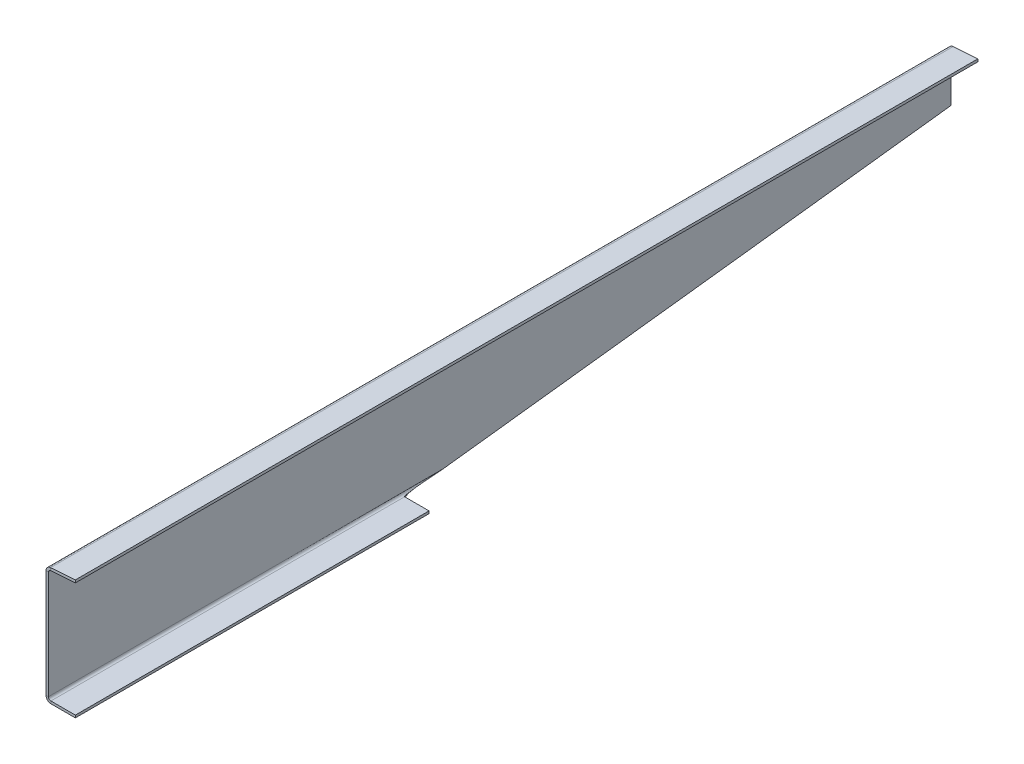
ISO-10303-21;
HEADER;
FILE_DESCRIPTION(('STEP AP214'),'2;1');
FILE_NAME('part.step','',(''),(''),'','','');
FILE_SCHEMA(('AUTOMOTIVE_DESIGN { 1 0 10303 214 1 1 1 1 }'));
ENDSEC;
DATA;
#1=APPLICATION_CONTEXT('core data for automotive mechanical design processes');
#2=APPLICATION_PROTOCOL_DEFINITION('international standard','automotive_design',2000,#1);
#3=PRODUCT_CONTEXT('',#1,'mechanical');
#4=PRODUCT('Part','Part','',(#3));
#5=PRODUCT_RELATED_PRODUCT_CATEGORY('part','',(#4));
#6=PRODUCT_DEFINITION_FORMATION('','',#4);
#7=PRODUCT_DEFINITION_CONTEXT('part definition',#1,'design');
#8=PRODUCT_DEFINITION('design','',#6,#7);
#9=PRODUCT_DEFINITION_SHAPE('','',#8);
#10=(LENGTH_UNIT() NAMED_UNIT(*) SI_UNIT(.MILLI.,.METRE.));
#11=(NAMED_UNIT(*) PLANE_ANGLE_UNIT() SI_UNIT($,.RADIAN.));
#12=(NAMED_UNIT(*) SI_UNIT($,.STERADIAN.) SOLID_ANGLE_UNIT());
#13=UNCERTAINTY_MEASURE_WITH_UNIT(LENGTH_MEASURE(1.E-05),#10,'distance_accuracy_value','');
#14=(GEOMETRIC_REPRESENTATION_CONTEXT(3) GLOBAL_UNCERTAINTY_ASSIGNED_CONTEXT((#13)) GLOBAL_UNIT_ASSIGNED_CONTEXT((#10,
#11,#12)) REPRESENTATION_CONTEXT('',''));
#15=CARTESIAN_POINT('',(0.,0.,0.));
#16=DIRECTION('',(0.,0.,1.));
#17=DIRECTION('',(1.,0.,0.));
#18=AXIS2_PLACEMENT_3D('',#15,#16,#17);
#19=CARTESIAN_POINT('',(12.2570463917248,299.291590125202,0.));
#20=DIRECTION('',(0.,0.,-1.));
#21=DIRECTION('',(-1.,0.,0.));
#22=AXIS2_PLACEMENT_3D('',#19,#20,#21);
#23=PLANE('',#22);
#24=DIRECTION('',(0.,1.,0.));
#25=VECTOR('',#24,1.);
#26=CARTESIAN_POINT('',(6.35,0.,0.));
#27=LINE('',#26,#25);
#28=CARTESIAN_POINT('',(6.35,170.415443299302,-2.22044604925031E-13));
#29=VERTEX_POINT('',#28);
#30=CARTESIAN_POINT('',(6.35,292.957058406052,0.));
#31=VERTEX_POINT('',#30);
#32=EDGE_CURVE('E186',#29,#31,#27,.T.);
#33=ORIENTED_EDGE('',*,*,#32,.F.);
#34=DIRECTION('',(1.,0.,0.));
#35=VECTOR('',#34,1.);
#36=CARTESIAN_POINT('',(6.35,170.415443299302,-2.22044604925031E-13));
#37=LINE('',#36,#35);
#38=CARTESIAN_POINT('',(0.,170.415443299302,-4.44089209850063E-13));
#39=VERTEX_POINT('',#38);
#40=EDGE_CURVE('E57',#29,#39,#37,.F.);
#41=ORIENTED_EDGE('',*,*,#40,.T.);
#42=DIRECTION('',(0.,1.,0.));
#43=VECTOR('',#42,1.);
#44=CARTESIAN_POINT('',(0.,0.,0.));
#45=LINE('',#44,#43);
#46=CARTESIAN_POINT('',(0.,292.957058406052,0.));
#47=VERTEX_POINT('',#46);
#48=EDGE_CURVE('E184',#39,#47,#45,.T.);
#49=ORIENTED_EDGE('',*,*,#48,.T.);
#50=DIRECTION('',(1.,0.,0.));
#51=VECTOR('',#50,1.);
#52=CARTESIAN_POINT('',(0.,292.957058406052,0.));
#53=LINE('',#52,#51);
#54=EDGE_CURVE('E218',#47,#31,#53,.T.);
#55=ORIENTED_EDGE('',*,*,#54,.T.);
#56=EDGE_LOOP('',(#33,#41,#49,#55));
#57=FACE_BOUND('',#56,.T.);
#58=ADVANCED_FACE('F42',(#57),#23,.T.);
#59=CARTESIAN_POINT('',(0.,0.,2343.15));
#60=DIRECTION('',(-1.,0.,0.));
#61=DIRECTION('',(0.,0.,1.));
#62=AXIS2_PLACEMENT_3D('',#59,#60,#61);
#63=PLANE('',#62);
#64=ORIENTED_EDGE('',*,*,#48,.F.);
#65=DIRECTION('',(0.,0.118750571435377,-0.992924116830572));
#66=VECTOR('',#65,1.);
#67=CARTESIAN_POINT('',(0.,-108.269237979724,2330.20134293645));
#68=LINE('',#67,#66);
#69=CARTESIAN_POINT('',(0.,12.7000000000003,1318.72600995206));
#70=VERTEX_POINT('',#69);
#71=EDGE_CURVE('E324',#70,#39,#68,.T.);
#72=ORIENTED_EDGE('',*,*,#71,.F.);
#73=DIRECTION('',(0.,0.,-1.));
#74=VECTOR('',#73,1.);
#75=CARTESIAN_POINT('',(0.,12.7000000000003,2343.15));
#76=LINE('',#75,#74);
#77=CARTESIAN_POINT('',(0.,12.7000000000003,2343.15));
#78=VERTEX_POINT('',#77);
#79=EDGE_CURVE('E203',#78,#70,#76,.T.);
#80=ORIENTED_EDGE('',*,*,#79,.F.);
#81=DIRECTION('',(0.,1.,0.));
#82=VECTOR('',#81,1.);
#83=CARTESIAN_POINT('',(0.,0.,2343.15));
#84=LINE('',#83,#82);
#85=CARTESIAN_POINT('',(0.,292.957058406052,2343.15));
#86=VERTEX_POINT('',#85);
#87=EDGE_CURVE('E136',#78,#86,#84,.T.);
#88=ORIENTED_EDGE('',*,*,#87,.T.);
#89=DIRECTION('',(0.,0.,-1.));
#90=VECTOR('',#89,1.);
#91=CARTESIAN_POINT('',(0.,292.957058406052,2343.15));
#92=LINE('',#91,#90);
#93=EDGE_CURVE('E206',#86,#47,#92,.T.);
#94=ORIENTED_EDGE('',*,*,#93,.T.);
#95=EDGE_LOOP('',(#64,#72,#80,#88,#94));
#96=FACE_BOUND('',#95,.T.);
#97=ADVANCED_FACE('F233',(#96),#63,.T.);
#98=CARTESIAN_POINT('',(12.7,12.7000000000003,2343.15));
#99=DIRECTION('',(0.,0.,-1.));
#100=DIRECTION('',(-1.,0.,0.));
#101=AXIS2_PLACEMENT_3D('',#98,#99,#100);
#102=CYLINDRICAL_SURFACE('',#101,12.7);
#103=ORIENTED_EDGE('',*,*,#79,.T.);
#104=CARTESIAN_POINT('',(12.7,12.7000000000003,1318.72600995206));
#105=DIRECTION('',(0.,0.992924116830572,0.118750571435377));
#106=DIRECTION('',(0.,0.118750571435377,-0.992924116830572));
#107=AXIS2_PLACEMENT_3D('',#104,#105,#106);
#108=ELLIPSE('',#107,106.946853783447,12.7);
#109=CARTESIAN_POINT('',(12.7000000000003,1.77635683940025E-12,1424.91612029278));
#110=VERTEX_POINT('',#109);
#111=EDGE_CURVE('E329',#110,#70,#108,.F.);
#112=ORIENTED_EDGE('',*,*,#111,.F.);
#113=DIRECTION('',(0.,0.,-1.));
#114=VECTOR('',#113,1.);
#115=CARTESIAN_POINT('',(12.7000000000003,2.96059473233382E-13,2343.15));
#116=LINE('',#115,#114);
#117=CARTESIAN_POINT('',(12.7000000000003,2.96059473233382E-13,2343.15));
#118=VERTEX_POINT('',#117);
#119=EDGE_CURVE('E200',#118,#110,#116,.T.);
#120=ORIENTED_EDGE('',*,*,#119,.F.);
#121=CARTESIAN_POINT('',(12.7,12.7000000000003,2343.15));
#122=DIRECTION('',(0.,0.,-1.));
#123=DIRECTION('',(-1.,0.,0.));
#124=AXIS2_PLACEMENT_3D('',#121,#122,#123);
#125=CIRCLE('',#124,12.7);
#126=EDGE_CURVE('E235',#118,#78,#125,.T.);
#127=ORIENTED_EDGE('',*,*,#126,.T.);
#128=EDGE_LOOP('',(#103,#112,#120,#127));
#129=FACE_BOUND('',#128,.T.);
#130=ADVANCED_FACE('F292',(#129),#102,.T.);
#131=CARTESIAN_POINT('',(76.2,1.77635683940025E-12,2343.15));
#132=DIRECTION('',(0.,-1.,0.));
#133=DIRECTION('',(1.,0.,0.));
#134=AXIS2_PLACEMENT_3D('',#131,#132,#133);
#135=PLANE('',#134);
#136=ORIENTED_EDGE('',*,*,#119,.T.);
#137=DIRECTION('',(1.,0.,0.));
#138=VECTOR('',#137,1.);
#139=CARTESIAN_POINT('',(0.,1.77635683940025E-12,1424.91612029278));
#140=LINE('',#139,#138);
#141=CARTESIAN_POINT('',(76.2,1.77635683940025E-12,1424.91612029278));
#142=VERTEX_POINT('',#141);
#143=EDGE_CURVE('E278',#110,#142,#140,.T.);
#144=ORIENTED_EDGE('',*,*,#143,.T.);
#145=DIRECTION('',(0.,0.,-1.));
#146=VECTOR('',#145,1.);
#147=CARTESIAN_POINT('',(76.2,1.77635683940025E-12,2343.15));
#148=LINE('',#147,#146);
#149=CARTESIAN_POINT('',(76.2,1.77635683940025E-12,2343.15));
#150=VERTEX_POINT('',#149);
#151=EDGE_CURVE('E197',#150,#142,#148,.T.);
#152=ORIENTED_EDGE('',*,*,#151,.F.);
#153=DIRECTION('',(-1.,0.,0.));
#154=VECTOR('',#153,1.);
#155=CARTESIAN_POINT('',(76.2,1.77635683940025E-12,2343.15));
#156=LINE('',#155,#154);
#157=EDGE_CURVE('E237',#150,#118,#156,.T.);
#158=ORIENTED_EDGE('',*,*,#157,.T.);
#159=EDGE_LOOP('',(#136,#144,#152,#158));
#160=FACE_BOUND('',#159,.T.);
#161=ADVANCED_FACE('F282',(#160),#135,.T.);
#162=CARTESIAN_POINT('',(76.1999999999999,6.35000000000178,2343.15));
#163=DIRECTION('',(1.,0.,0.));
#164=DIRECTION('',(0.,1.,0.));
#165=AXIS2_PLACEMENT_3D('',#162,#163,#164);
#166=PLANE('',#165);
#167=ORIENTED_EDGE('',*,*,#151,.T.);
#168=DIRECTION('',(0.,-1.,0.));
#169=VECTOR('',#168,1.);
#170=CARTESIAN_POINT('',(76.2,1.77635683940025E-12,1424.91612029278));
#171=LINE('',#170,#169);
#172=CARTESIAN_POINT('',(76.1999999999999,6.35000000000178,1424.91612029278));
#173=VERTEX_POINT('',#172);
#174=EDGE_CURVE('E275',#142,#173,#171,.F.);
#175=ORIENTED_EDGE('',*,*,#174,.T.);
#176=DIRECTION('',(0.,0.,-1.));
#177=VECTOR('',#176,1.);
#178=CARTESIAN_POINT('',(76.1999999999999,6.35000000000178,2343.15));
#179=LINE('',#178,#177);
#180=CARTESIAN_POINT('',(76.1999999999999,6.35000000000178,2343.15));
#181=VERTEX_POINT('',#180);
#182=EDGE_CURVE('E194',#181,#173,#179,.T.);
#183=ORIENTED_EDGE('',*,*,#182,.F.);
#184=DIRECTION('',(0.,-1.,0.));
#185=VECTOR('',#184,1.);
#186=CARTESIAN_POINT('',(76.1999999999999,6.35000000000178,2343.15));
#187=LINE('',#186,#185);
#188=EDGE_CURVE('E243',#181,#150,#187,.T.);
#189=ORIENTED_EDGE('',*,*,#188,.T.);
#190=EDGE_LOOP('',(#167,#175,#183,#189));
#191=FACE_BOUND('',#190,.T.);
#192=ADVANCED_FACE('F284',(#191),#166,.T.);
#193=CARTESIAN_POINT('',(76.1999999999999,6.35000000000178,2343.15));
#194=DIRECTION('',(0.,-1.,0.));
#195=DIRECTION('',(1.,0.,0.));
#196=AXIS2_PLACEMENT_3D('',#193,#194,#195);
#197=PLANE('',#196);
#198=DIRECTION('',(1.,0.,0.));
#199=VECTOR('',#198,1.);
#200=CARTESIAN_POINT('',(76.1999999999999,6.35000000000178,1424.91612029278));
#201=LINE('',#200,#199);
#202=CARTESIAN_POINT('',(12.7000000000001,6.3500000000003,1424.91612029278));
#203=VERTEX_POINT('',#202);
#204=EDGE_CURVE('E257',#203,#173,#201,.T.);
#205=ORIENTED_EDGE('',*,*,#204,.F.);
#206=DIRECTION('',(0.,0.,-1.));
#207=VECTOR('',#206,1.);
#208=CARTESIAN_POINT('',(12.7000000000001,6.3500000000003,2343.15));
#209=LINE('',#208,#207);
#210=CARTESIAN_POINT('',(12.7000000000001,6.3500000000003,2343.15));
#211=VERTEX_POINT('',#210);
#212=EDGE_CURVE('E160',#211,#203,#209,.T.);
#213=ORIENTED_EDGE('',*,*,#212,.F.);
#214=DIRECTION('',(-1.,0.,0.));
#215=VECTOR('',#214,1.);
#216=CARTESIAN_POINT('',(76.1999999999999,6.35000000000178,2343.15));
#217=LINE('',#216,#215);
#218=EDGE_CURVE('E150',#181,#211,#217,.T.);
#219=ORIENTED_EDGE('',*,*,#218,.F.);
#220=ORIENTED_EDGE('',*,*,#182,.T.);
#221=EDGE_LOOP('',(#205,#213,#219,#220));
#222=FACE_BOUND('',#221,.T.);
#223=ADVANCED_FACE('F254',(#222),#197,.F.);
#224=CARTESIAN_POINT('',(12.7,12.7000000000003,2343.15));
#225=DIRECTION('',(0.,0.,-1.));
#226=DIRECTION('',(-1.,0.,0.));
#227=AXIS2_PLACEMENT_3D('',#224,#225,#226);
#228=CYLINDRICAL_SURFACE('',#227,6.35);
#229=CARTESIAN_POINT('',(12.7,12.7000000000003,1318.72600995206));
#230=DIRECTION('',(0.,0.998216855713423,0.0596917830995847));
#231=DIRECTION('',(0.,0.0596917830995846,-0.998216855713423));
#232=AXIS2_PLACEMENT_3D('',#229,#230,#231);
#233=ELLIPSE('',#232,106.379800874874,6.35);
#234=CARTESIAN_POINT('',(6.35,12.7000000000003,1318.72600995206));
#235=VERTEX_POINT('',#234);
#236=EDGE_CURVE('E158',#203,#235,#233,.F.);
#237=ORIENTED_EDGE('',*,*,#236,.T.);
#238=DIRECTION('',(0.,0.,-1.));
#239=VECTOR('',#238,1.);
#240=CARTESIAN_POINT('',(6.35,12.7000000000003,2343.15));
#241=LINE('',#240,#239);
#242=CARTESIAN_POINT('',(6.35,12.7000000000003,2343.15));
#243=VERTEX_POINT('',#242);
#244=EDGE_CURVE('E154',#243,#235,#241,.T.);
#245=ORIENTED_EDGE('',*,*,#244,.F.);
#246=CARTESIAN_POINT('',(12.7,12.7000000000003,2343.15));
#247=DIRECTION('',(0.,0.,1.));
#248=DIRECTION('',(1.,0.,0.));
#249=AXIS2_PLACEMENT_3D('',#246,#247,#248);
#250=CIRCLE('',#249,6.35);
#251=EDGE_CURVE('E144',#211,#243,#250,.F.);
#252=ORIENTED_EDGE('',*,*,#251,.F.);
#253=ORIENTED_EDGE('',*,*,#212,.T.);
#254=EDGE_LOOP('',(#237,#245,#252,#253));
#255=FACE_BOUND('',#254,.T.);
#256=ADVANCED_FACE('F155',(#255),#228,.F.);
#257=CARTESIAN_POINT('',(6.35,0.,2343.15));
#258=DIRECTION('',(-1.,0.,0.));
#259=DIRECTION('',(0.,0.,1.));
#260=AXIS2_PLACEMENT_3D('',#257,#258,#259);
#261=PLANE('',#260);
#262=DIRECTION('',(0.,0.118750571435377,-0.992924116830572));
#263=VECTOR('',#262,1.);
#264=CARTESIAN_POINT('',(6.35,-108.269237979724,2330.20134293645));
#265=LINE('',#264,#263);
#266=EDGE_CURVE('E326',#235,#29,#265,.T.);
#267=ORIENTED_EDGE('',*,*,#266,.T.);
#268=ORIENTED_EDGE('',*,*,#32,.T.);
#269=DIRECTION('',(0.,0.,-1.));
#270=VECTOR('',#269,1.);
#271=CARTESIAN_POINT('',(6.35,292.957058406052,2343.15));
#272=LINE('',#271,#270);
#273=CARTESIAN_POINT('',(6.35,292.957058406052,2343.15));
#274=VERTEX_POINT('',#273);
#275=EDGE_CURVE('E161',#274,#31,#272,.T.);
#276=ORIENTED_EDGE('',*,*,#275,.F.);
#277=DIRECTION('',(0.,1.,0.));
#278=VECTOR('',#277,1.);
#279=CARTESIAN_POINT('',(6.35,0.,2343.15));
#280=LINE('',#279,#278);
#281=EDGE_CURVE('E133',#243,#274,#280,.T.);
#282=ORIENTED_EDGE('',*,*,#281,.F.);
#283=ORIENTED_EDGE('',*,*,#244,.T.);
#284=EDGE_LOOP('',(#267,#268,#276,#282,#283));
#285=FACE_BOUND('',#284,.T.);
#286=ADVANCED_FACE('F163',(#285),#261,.F.);
#287=CARTESIAN_POINT('',(11.8140927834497,305.626121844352,2343.15));
#288=DIRECTION('',(0.,0.,1.));
#289=DIRECTION('',(1.,0.,0.));
#290=AXIS2_PLACEMENT_3D('',#287,#288,#289);
#291=PLANE('',#290);
#292=DIRECTION('',(0.0697564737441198,-0.997564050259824,0.));
#293=VECTOR('',#292,1.);
#294=CARTESIAN_POINT('',(11.8140927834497,305.626121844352,2343.15));
#295=LINE('',#294,#293);
#296=CARTESIAN_POINT('',(11.8140927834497,305.626121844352,2343.15));
#297=VERTEX_POINT('',#296);
#298=CARTESIAN_POINT('',(12.2570463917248,299.291590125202,2343.15));
#299=VERTEX_POINT('',#298);
#300=EDGE_CURVE('E11',#297,#299,#295,.T.);
#301=ORIENTED_EDGE('',*,*,#300,.F.);
#302=CARTESIAN_POINT('',(12.7,292.957058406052,2343.15));
#303=DIRECTION('',(0.,0.,-1.));
#304=DIRECTION('',(-1.,0.,0.));
#305=AXIS2_PLACEMENT_3D('',#302,#303,#304);
#306=CIRCLE('',#305,12.7);
#307=EDGE_CURVE('E227',#86,#297,#306,.T.);
#308=ORIENTED_EDGE('',*,*,#307,.F.);
#309=DIRECTION('',(-1.,0.,0.));
#310=VECTOR('',#309,1.);
#311=CARTESIAN_POINT('',(6.35,292.957058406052,2343.15));
#312=LINE('',#311,#310);
#313=EDGE_CURVE('E50',#274,#86,#312,.T.);
#314=ORIENTED_EDGE('',*,*,#313,.F.);
#315=CARTESIAN_POINT('',(12.7,292.957058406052,2343.15));
#316=DIRECTION('',(0.,0.,1.));
#317=DIRECTION('',(1.,0.,0.));
#318=AXIS2_PLACEMENT_3D('',#315,#316,#317);
#319=CIRCLE('',#318,6.35);
#320=EDGE_CURVE('E166',#274,#299,#319,.F.);
#321=ORIENTED_EDGE('',*,*,#320,.T.);
#322=EDGE_LOOP('',(#301,#308,#314,#321));
#323=FACE_BOUND('',#322,.T.);
#324=ADVANCED_FACE('F44',(#323),#291,.T.);
#325=CARTESIAN_POINT('',(6.35,292.957058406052,2343.15));
#326=DIRECTION('',(0.,0.,1.));
#327=DIRECTION('',(1.,0.,0.));
#328=AXIS2_PLACEMENT_3D('',#325,#326,#327);
#329=PLANE('',#328);
#330=DIRECTION('',(0.997564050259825,0.06975647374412,0.));
#331=VECTOR('',#330,1.);
#332=CARTESIAN_POINT('',(0.,304.8,2343.15));
#333=LINE('',#332,#331);
#334=CARTESIAN_POINT('',(76.0143806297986,310.115443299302,2343.15));
#335=VERTEX_POINT('',#334);
#336=EDGE_CURVE('E231',#297,#335,#333,.T.);
#337=ORIENTED_EDGE('',*,*,#336,.F.);
#338=ORIENTED_EDGE('',*,*,#300,.T.);
#339=DIRECTION('',(0.997564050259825,0.0697564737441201,0.));
#340=VECTOR('',#339,1.);
#341=CARTESIAN_POINT('',(0.442953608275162,298.46546828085,2343.15));
#342=LINE('',#341,#340);
#343=CARTESIAN_POINT('',(76.4573342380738,303.780911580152,2343.15));
#344=VERTEX_POINT('',#343);
#345=EDGE_CURVE('E98',#299,#344,#342,.T.);
#346=ORIENTED_EDGE('',*,*,#345,.T.);
#347=DIRECTION('',(0.0697564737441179,-0.997564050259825,0.));
#348=VECTOR('',#347,1.);
#349=CARTESIAN_POINT('',(76.0143806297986,310.115443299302,2343.15));
#350=LINE('',#349,#348);
#351=EDGE_CURVE('E314',#335,#344,#350,.T.);
#352=ORIENTED_EDGE('',*,*,#351,.F.);
#353=EDGE_LOOP('',(#337,#338,#346,#352));
#354=FACE_BOUND('',#353,.T.);
#355=ADVANCED_FACE('F307',(#354),#329,.T.);
#356=CARTESIAN_POINT('',(0.,292.957058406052,0.));
#357=DIRECTION('',(0.,0.,-1.));
#358=DIRECTION('',(-1.,0.,0.));
#359=AXIS2_PLACEMENT_3D('',#356,#357,#358);
#360=PLANE('',#359);
#361=ORIENTED_EDGE('',*,*,#54,.F.);
#362=CARTESIAN_POINT('',(12.7,292.957058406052,0.));
#363=DIRECTION('',(0.,0.,-1.));
#364=DIRECTION('',(-1.,0.,0.));
#365=AXIS2_PLACEMENT_3D('',#362,#363,#364);
#366=CIRCLE('',#365,12.7);
#367=CARTESIAN_POINT('',(11.8140927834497,305.626121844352,0.));
#368=VERTEX_POINT('',#367);
#369=EDGE_CURVE('E182',#47,#368,#366,.T.);
#370=ORIENTED_EDGE('',*,*,#369,.T.);
#371=DIRECTION('',(-0.0697564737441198,0.997564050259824,0.));
#372=VECTOR('',#371,1.);
#373=CARTESIAN_POINT('',(12.2570463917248,299.291590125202,0.));
#374=LINE('',#373,#372);
#375=CARTESIAN_POINT('',(12.2570463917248,299.291590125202,0.));
#376=VERTEX_POINT('',#375);
#377=EDGE_CURVE('E92',#376,#368,#374,.T.);
#378=ORIENTED_EDGE('',*,*,#377,.F.);
#379=CARTESIAN_POINT('',(12.7,292.957058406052,0.));
#380=DIRECTION('',(0.,0.,1.));
#381=DIRECTION('',(1.,0.,0.));
#382=AXIS2_PLACEMENT_3D('',#379,#380,#381);
#383=CIRCLE('',#382,6.35);
#384=EDGE_CURVE('E188',#31,#376,#383,.F.);
#385=ORIENTED_EDGE('',*,*,#384,.F.);
#386=EDGE_LOOP('',(#361,#370,#378,#385));
#387=FACE_BOUND('',#386,.T.);
#388=ADVANCED_FACE('F305',(#387),#360,.T.);
#389=CARTESIAN_POINT('',(0.,12.7000000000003,2343.15));
#390=DIRECTION('',(0.,0.,1.));
#391=DIRECTION('',(1.,0.,0.));
#392=AXIS2_PLACEMENT_3D('',#389,#390,#391);
#393=PLANE('',#392);
#394=DIRECTION('',(1.,0.,0.));
#395=VECTOR('',#394,1.);
#396=CARTESIAN_POINT('',(0.,12.7000000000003,2343.15));
#397=LINE('',#396,#395);
#398=EDGE_CURVE('E129',#78,#243,#397,.T.);
#399=ORIENTED_EDGE('',*,*,#398,.F.);
#400=ORIENTED_EDGE('',*,*,#126,.F.);
#401=DIRECTION('',(0.,-1.,0.));
#402=VECTOR('',#401,1.);
#403=CARTESIAN_POINT('',(12.7000000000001,6.3500000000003,2343.15));
#404=LINE('',#403,#402);
#405=EDGE_CURVE('E141',#211,#118,#404,.T.);
#406=ORIENTED_EDGE('',*,*,#405,.F.);
#407=ORIENTED_EDGE('',*,*,#251,.T.);
#408=EDGE_LOOP('',(#399,#400,#406,#407));
#409=FACE_BOUND('',#408,.T.);
#410=ADVANCED_FACE('F146',(#409),#393,.T.);
#411=CARTESIAN_POINT('',(12.7000000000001,6.3500000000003,2343.15));
#412=DIRECTION('',(0.,0.,1.));
#413=DIRECTION('',(1.,0.,0.));
#414=AXIS2_PLACEMENT_3D('',#411,#412,#413);
#415=PLANE('',#414);
#416=ORIENTED_EDGE('',*,*,#87,.F.);
#417=ORIENTED_EDGE('',*,*,#398,.T.);
#418=ORIENTED_EDGE('',*,*,#281,.T.);
#419=ORIENTED_EDGE('',*,*,#313,.T.);
#420=EDGE_LOOP('',(#416,#417,#418,#419));
#421=FACE_BOUND('',#420,.T.);
#422=ADVANCED_FACE('F131',(#421),#415,.T.);
#423=CARTESIAN_POINT('',(0.442953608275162,298.46546828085,2343.15));
#424=DIRECTION('',(-0.0697564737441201,0.997564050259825,0.));
#425=DIRECTION('',(-0.997564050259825,-0.0697564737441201,0.));
#426=AXIS2_PLACEMENT_3D('',#423,#424,#425);
#427=PLANE('',#426);
#428=DIRECTION('',(0.997564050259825,0.0697564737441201,0.));
#429=VECTOR('',#428,1.);
#430=CARTESIAN_POINT('',(0.442953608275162,298.46546828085,0.));
#431=LINE('',#430,#429);
#432=CARTESIAN_POINT('',(76.4573342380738,303.780911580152,0.));
#433=VERTEX_POINT('',#432);
#434=EDGE_CURVE('E172',#376,#433,#431,.T.);
#435=ORIENTED_EDGE('',*,*,#434,.T.);
#436=DIRECTION('',(0.,0.,-1.));
#437=VECTOR('',#436,1.);
#438=CARTESIAN_POINT('',(76.4573342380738,303.780911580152,2343.15));
#439=LINE('',#438,#437);
#440=EDGE_CURVE('E214',#344,#433,#439,.T.);
#441=ORIENTED_EDGE('',*,*,#440,.F.);
#442=ORIENTED_EDGE('',*,*,#345,.F.);
#443=DIRECTION('',(0.,0.,-1.));
#444=VECTOR('',#443,1.);
#445=CARTESIAN_POINT('',(12.2570463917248,299.291590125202,2343.15));
#446=LINE('',#445,#444);
#447=EDGE_CURVE('E168',#299,#376,#446,.T.);
#448=ORIENTED_EDGE('',*,*,#447,.T.);
#449=EDGE_LOOP('',(#435,#441,#442,#448));
#450=FACE_BOUND('',#449,.T.);
#451=ADVANCED_FACE('F349',(#450),#427,.F.);
#452=CARTESIAN_POINT('',(76.0143806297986,310.115443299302,2343.15));
#453=DIRECTION('',(0.997564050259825,0.0697564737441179,0.));
#454=DIRECTION('',(-0.0697564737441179,0.997564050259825,0.));
#455=AXIS2_PLACEMENT_3D('',#452,#453,#454);
#456=PLANE('',#455);
#457=DIRECTION('',(0.0697564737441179,-0.997564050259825,0.));
#458=VECTOR('',#457,1.);
#459=CARTESIAN_POINT('',(76.0143806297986,310.115443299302,0.));
#460=LINE('',#459,#458);
#461=CARTESIAN_POINT('',(76.0143806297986,310.115443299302,0.));
#462=VERTEX_POINT('',#461);
#463=EDGE_CURVE('E175',#462,#433,#460,.T.);
#464=ORIENTED_EDGE('',*,*,#463,.F.);
#465=DIRECTION('',(0.,0.,-1.));
#466=VECTOR('',#465,1.);
#467=CARTESIAN_POINT('',(76.0143806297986,310.115443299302,2343.15));
#468=LINE('',#467,#466);
#469=EDGE_CURVE('E212',#335,#462,#468,.T.);
#470=ORIENTED_EDGE('',*,*,#469,.F.);
#471=ORIENTED_EDGE('',*,*,#351,.T.);
#472=ORIENTED_EDGE('',*,*,#440,.T.);
#473=EDGE_LOOP('',(#464,#470,#471,#472));
#474=FACE_BOUND('',#473,.T.);
#475=ADVANCED_FACE('F346',(#474),#456,.T.);
#476=CARTESIAN_POINT('',(0.,304.8,2343.15));
#477=DIRECTION('',(-0.0697564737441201,0.997564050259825,0.));
#478=DIRECTION('',(-0.997564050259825,-0.0697564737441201,0.));
#479=AXIS2_PLACEMENT_3D('',#476,#477,#478);
#480=PLANE('',#479);
#481=DIRECTION('',(0.997564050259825,0.06975647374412,0.));
#482=VECTOR('',#481,1.);
#483=CARTESIAN_POINT('',(0.,304.8,0.));
#484=LINE('',#483,#482);
#485=EDGE_CURVE('E179',#368,#462,#484,.T.);
#486=ORIENTED_EDGE('',*,*,#485,.F.);
#487=DIRECTION('',(0.,0.,-1.));
#488=VECTOR('',#487,1.);
#489=CARTESIAN_POINT('',(11.8140927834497,305.626121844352,2343.15));
#490=LINE('',#489,#488);
#491=EDGE_CURVE('E209',#297,#368,#490,.T.);
#492=ORIENTED_EDGE('',*,*,#491,.F.);
#493=ORIENTED_EDGE('',*,*,#336,.T.);
#494=ORIENTED_EDGE('',*,*,#469,.T.);
#495=EDGE_LOOP('',(#486,#492,#493,#494));
#496=FACE_BOUND('',#495,.T.);
#497=ADVANCED_FACE('F343',(#496),#480,.T.);
#498=CARTESIAN_POINT('',(12.7,292.957058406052,2343.15));
#499=DIRECTION('',(0.,0.,-1.));
#500=DIRECTION('',(-1.,0.,0.));
#501=AXIS2_PLACEMENT_3D('',#498,#499,#500);
#502=CYLINDRICAL_SURFACE('',#501,12.7);
#503=ORIENTED_EDGE('',*,*,#369,.F.);
#504=ORIENTED_EDGE('',*,*,#93,.F.);
#505=ORIENTED_EDGE('',*,*,#307,.T.);
#506=ORIENTED_EDGE('',*,*,#491,.T.);
#507=EDGE_LOOP('',(#503,#504,#505,#506));
#508=FACE_BOUND('',#507,.T.);
#509=ADVANCED_FACE('F226',(#508),#502,.T.);
#510=CARTESIAN_POINT('',(12.7,292.957058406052,2343.15));
#511=DIRECTION('',(0.,0.,-1.));
#512=DIRECTION('',(-1.,0.,0.));
#513=AXIS2_PLACEMENT_3D('',#510,#511,#512);
#514=CYLINDRICAL_SURFACE('',#513,6.35);
#515=ORIENTED_EDGE('',*,*,#384,.T.);
#516=ORIENTED_EDGE('',*,*,#447,.F.);
#517=ORIENTED_EDGE('',*,*,#320,.F.);
#518=ORIENTED_EDGE('',*,*,#275,.T.);
#519=EDGE_LOOP('',(#515,#516,#517,#518));
#520=FACE_BOUND('',#519,.T.);
#521=ADVANCED_FACE('F342',(#520),#514,.F.);
#522=CARTESIAN_POINT('',(12.7,292.957058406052,2343.15));
#523=DIRECTION('',(0.,0.,-1.));
#524=DIRECTION('',(-1.,0.,0.));
#525=AXIS2_PLACEMENT_3D('',#522,#523,#524);
#526=PLANE('',#525);
#527=ORIENTED_EDGE('',*,*,#218,.T.);
#528=ORIENTED_EDGE('',*,*,#405,.T.);
#529=ORIENTED_EDGE('',*,*,#157,.F.);
#530=ORIENTED_EDGE('',*,*,#188,.F.);
#531=EDGE_LOOP('',(#527,#528,#529,#530));
#532=FACE_BOUND('',#531,.T.);
#533=ADVANCED_FACE('F249',(#532),#526,.F.);
#534=CARTESIAN_POINT('',(12.7,292.957058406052,0.));
#535=DIRECTION('',(0.,0.,-1.));
#536=DIRECTION('',(-1.,0.,0.));
#537=AXIS2_PLACEMENT_3D('',#534,#535,#536);
#538=PLANE('',#537);
#539=ORIENTED_EDGE('',*,*,#434,.F.);
#540=ORIENTED_EDGE('',*,*,#377,.T.);
#541=ORIENTED_EDGE('',*,*,#485,.T.);
#542=ORIENTED_EDGE('',*,*,#463,.T.);
#543=EDGE_LOOP('',(#539,#540,#541,#542));
#544=FACE_BOUND('',#543,.T.);
#545=ADVANCED_FACE('F425',(#544),#538,.T.);
#546=CARTESIAN_POINT('',(0.,1.77635683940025E-12,1424.91612029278));
#547=DIRECTION('',(0.,0.,-1.));
#548=DIRECTION('',(1.,0.,0.));
#549=AXIS2_PLACEMENT_3D('',#546,#547,#548);
#550=PLANE('',#549);
#551=ORIENTED_EDGE('',*,*,#143,.F.);
#552=DIRECTION('',(0.,-1.,0.));
#553=VECTOR('',#552,1.);
#554=CARTESIAN_POINT('',(12.7000000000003,1.77635683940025E-12,1424.91612029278));
#555=LINE('',#554,#553);
#556=EDGE_CURVE('E176',#110,#203,#555,.F.);
#557=ORIENTED_EDGE('',*,*,#556,.T.);
#558=ORIENTED_EDGE('',*,*,#204,.T.);
#559=ORIENTED_EDGE('',*,*,#174,.F.);
#560=EDGE_LOOP('',(#551,#557,#558,#559));
#561=FACE_BOUND('',#560,.T.);
#562=ADVANCED_FACE('F277',(#561),#550,.T.);
#563=CARTESIAN_POINT('',(6.35,-108.269237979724,2330.20134293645));
#564=DIRECTION('',(0.,0.992924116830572,0.118750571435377));
#565=DIRECTION('',(0.,0.118750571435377,-0.992924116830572));
#566=AXIS2_PLACEMENT_3D('',#563,#564,#565);
#567=PLANE('',#566);
#568=ORIENTED_EDGE('',*,*,#40,.F.);
#569=ORIENTED_EDGE('',*,*,#266,.F.);
#570=DIRECTION('',(1.,0.,0.));
#571=VECTOR('',#570,1.);
#572=CARTESIAN_POINT('',(6.35,12.7000000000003,1318.72600995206));
#573=LINE('',#572,#571);
#574=EDGE_CURVE('E321',#235,#70,#573,.F.);
#575=ORIENTED_EDGE('',*,*,#574,.T.);
#576=ORIENTED_EDGE('',*,*,#71,.T.);
#577=EDGE_LOOP('',(#568,#569,#575,#576));
#578=FACE_BOUND('',#577,.T.);
#579=ADVANCED_FACE('F334',(#578),#567,.F.);
#580=CARTESIAN_POINT('',(12.7,25.4000000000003,1212.53589961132));
#581=CARTESIAN_POINT('',(12.7,23.2833333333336,1212.53589961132));
#582=CARTESIAN_POINT('',(12.7,21.166666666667,1212.53589961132));
#583=CARTESIAN_POINT('',(12.7,19.0500000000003,1212.53589961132));
#584=CARTESIAN_POINT('',(38.1,25.4000000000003,1212.53589961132));
#585=CARTESIAN_POINT('',(33.8666666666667,23.2833333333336,1212.53589961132));
#586=CARTESIAN_POINT('',(29.6333333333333,21.166666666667,1212.53589961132));
#587=CARTESIAN_POINT('',(25.4,19.0500000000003,1212.53589961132));
#588=CARTESIAN_POINT('',(38.1,2.935271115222E-13,1424.91612029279));
#589=CARTESIAN_POINT('',(33.8666666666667,2.11666666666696,1424.91612029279));
#590=CARTESIAN_POINT('',(29.6333333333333,4.23333333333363,1424.91612029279));
#591=CARTESIAN_POINT('',(25.4,6.3500000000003,1424.91612029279));
#592=CARTESIAN_POINT('',(12.7,2.96637714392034E-13,1424.91612029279));
#593=CARTESIAN_POINT('',(12.7,2.11666666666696,1424.91612029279));
#594=CARTESIAN_POINT('',(12.7,4.23333333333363,1424.91612029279));
#595=CARTESIAN_POINT('',(12.7,6.3500000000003,1424.91612029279));
#596=CARTESIAN_POINT('',(-12.7,2.99748317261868E-13,1424.91612029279));
#597=CARTESIAN_POINT('',(-8.46666666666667,2.11666666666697,1424.91612029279));
#598=CARTESIAN_POINT('',(-4.23333333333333,4.23333333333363,1424.91612029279));
#599=CARTESIAN_POINT('',(0.,6.3500000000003,1424.91612029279));
#600=CARTESIAN_POINT('',(-12.7,25.4000000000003,1212.53589961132));
#601=CARTESIAN_POINT('',(-8.46666666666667,23.2833333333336,1212.53589961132));
#602=CARTESIAN_POINT('',(-4.23333333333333,21.166666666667,1212.53589961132));
#603=CARTESIAN_POINT('',(0.,19.0500000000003,1212.53589961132));
#604=CARTESIAN_POINT('',(12.7,25.4000000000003,1212.53589961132));
#605=CARTESIAN_POINT('',(12.7,23.2833333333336,1212.53589961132));
#606=CARTESIAN_POINT('',(12.7,21.166666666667,1212.53589961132));
#607=CARTESIAN_POINT('',(12.7,19.0500000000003,1212.53589961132));
#608=(BOUNDED_SURFACE() B_SPLINE_SURFACE(3,3,((#580,#581,#582,#583),(#584,#585,#586,#587),(#588,
#589,#590,#591),(#592,#593,#594,#595),(#596,#597,#598,#599),(#600,#601,#602,#603),(#604,#605,
#606,#607)),.UNSPECIFIED.,.T.,.F.,.F.) B_SPLINE_SURFACE_WITH_KNOTS((4,3,4),(4,4),(0.,0.5,1.),
(0.,1.),.UNSPECIFIED.) GEOMETRIC_REPRESENTATION_ITEM() RATIONAL_B_SPLINE_SURFACE(((1.,1.,1.,1.),
(0.333333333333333,0.333333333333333,0.333333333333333,0.333333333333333),(0.333333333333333,
0.333333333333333,0.333333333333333,0.333333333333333),(1.,1.,1.,1.),(0.333333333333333,
0.333333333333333,0.333333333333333,0.333333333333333),(0.333333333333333,0.333333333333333,
0.333333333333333,0.333333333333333),(1.,1.,1.,1.))) REPRESENTATION_ITEM('') SURFACE());
#609=ORIENTED_EDGE('',*,*,#111,.T.);
#610=ORIENTED_EDGE('',*,*,#574,.F.);
#611=ORIENTED_EDGE('',*,*,#236,.F.);
#612=ORIENTED_EDGE('',*,*,#556,.F.);
#613=EDGE_LOOP('',(#609,#610,#611,#612));
#614=FACE_BOUND('',#613,.T.);
#615=ADVANCED_FACE('F332',(#614),#608,.T.);
#616=CLOSED_SHELL('',(#58,#97,#130,#161,#192,#223,#256,#286,#324,#355,#388,#410,#422,#451,#475,
#497,#509,#521,#533,#545,#562,#579,#615));
#617=MANIFOLD_SOLID_BREP('B2',#616);
#618=ADVANCED_BREP_SHAPE_REPRESENTATION('',(#18,#617),#14);
#619=SHAPE_DEFINITION_REPRESENTATION(#9,#618);
ENDSEC;
END-ISO-10303-21;
